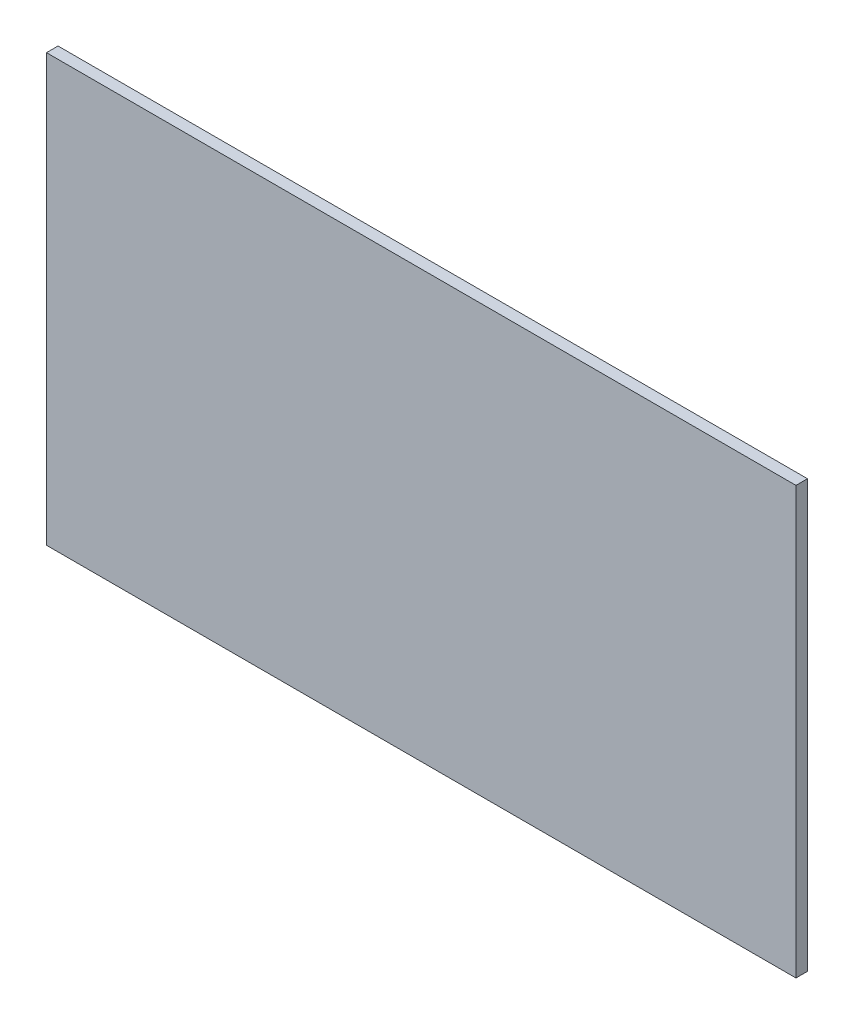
from build123d import *

# Parameters (mm, degrees)
SKETCH1_W      = 825.5
SKETCH1_H      = 469.9
EXTRUDE1_DEPTH = 6.35


with BuildPart() as part:
    # Sketch1 → Extrude1 (new, symmetric)
    with BuildSketch(Plane.XY):
        Rectangle(SKETCH1_W, SKETCH1_H)
    extrude(amount=EXTRUDE1_DEPTH, both=True)


solid = part.part
